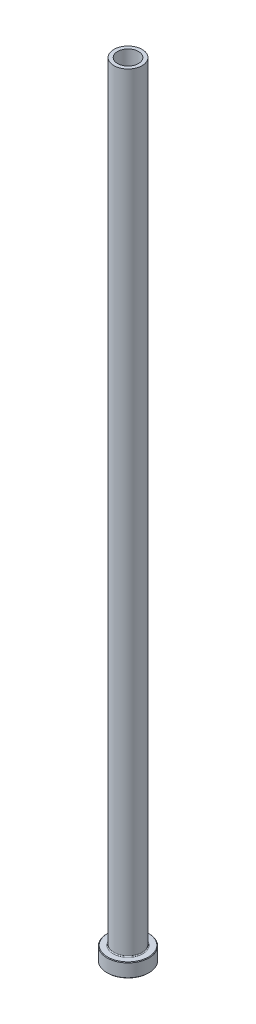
from build123d import *

# Parameters (mm, degrees)
CHAMFER1_SIZE = 0.254


with BuildPart() as part:
    # Sketch1 → Revolve1 (revolve)
    with BuildSketch(Plane.XY, mode=Mode.PRIVATE) as revolve1_sk:
        with BuildLine():
            Line((0, 0), (9.525, 0))
            Line((9.525, 0), (9.525, 6.35))
            Line((9.525, 6.35), (6.804025, 6.35))
            ThreePointArc((6.804025, 6.35), (6.523391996, 6.466241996), (6.40715, 6.746875))
            Line((6.40715, 6.746875), (6.40715, 355.6))
            Line((6.40715, 355.6), (0, 355.6))
            Line((0, 355.6), (0, 0))
        make_face()
    revolve(revolve1_sk.sketch.rotate(Axis((0, 0, 0), (0, 1, 0)), 90), axis=Axis((0, 0, 0), (0, 1, 0)))

    # Sketch2 → Cut-Revolve1 (revolve, cut)
    with BuildSketch(Plane.XY, mode=Mode.PRIVATE) as cut_revolve1_sk:
        Polygon((5.349875, 0), (4.953, 0.396875), (4.953, 281.1145), (4.7625, 295.402), (4.7625, 355.6), (0, 355.6), (0, 0), align=None)
    revolve(cut_revolve1_sk.sketch.rotate(Axis((0, 0, 0), (0, 1, 0)), 90), axis=Axis((0, 0, 0), (0, 1, 0)), mode=Mode.SUBTRACT)

    # Chamfer1
    chamfer1_edges = [part.edges().sort_by_distance(p)[0] for p in [
        (0, 6.35, 9.525),
        (0, 0, 9.525),
    ]]
    chamfer(chamfer1_edges, length=CHAMFER1_SIZE)


solid = part.part
